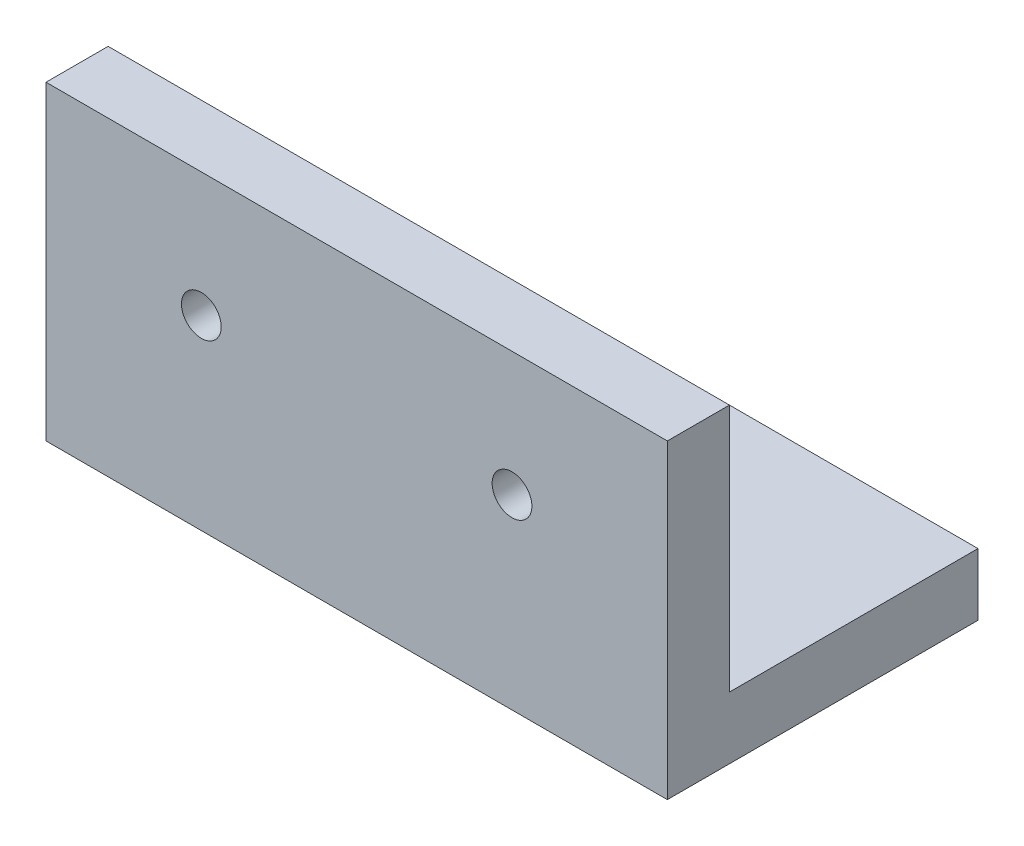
from build123d import *

# Parameters (mm, degrees)
SKETCH1_W           = 50
SKETCH1_H           = 25
BOSS_EXTRUDE1_DEPTH = 5
SKETCH2_W           = 50
SKETCH2_H           = 5
BOSS_EXTRUDE2_DEPTH = 20
SKETCH3_R           = 1.6
CUT_EXTRUDE1_DEPTH  = 45.900820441
SKETCH4_R           = 1.6
CUT_EXTRUDE2_DEPTH  = 45.900820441


with BuildPart() as part:
    # Sketch1 → Boss-Extrude1 (new body)
    with BuildSketch(Plane(origin=(0, 0, 0), x_dir=(1, 0, 0), z_dir=(0, 1, 0))):
        with Locations((6.481481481, 12.5)):
            Rectangle(SKETCH1_W, SKETCH1_H)
    extrude(amount=BOSS_EXTRUDE1_DEPTH)

    # Sketch2 → Boss-Extrude2 (add)
    with BuildSketch(Plane(origin=(0, 5, 0), x_dir=(1, 0, 0), z_dir=(0, 1, 0))):
        with Locations((6.481481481, 2.5)):
            Rectangle(SKETCH2_W, SKETCH2_H)
    extrude(amount=BOSS_EXTRUDE2_DEPTH)

    # Sketch3 → Cut-Extrude1 (cut, through all)
    with BuildSketch(Plane(origin=(0, 5, 0), x_dir=(1, 0, 0), z_dir=(0, 1, 0))):
        with Locations(Location((-6.018518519, 15, 0), (0, 0, 270))):
            Circle(SKETCH3_R)
    cut_extrude1 = extrude(amount=-CUT_EXTRUDE1_DEPTH, mode=Mode.SUBTRACT)

    # Mirror1: Cut-Extrude1 across plane
    add(cut_extrude1.mirror(Plane(origin=(6.481481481, 0, 0), x_dir=(0, 0, 1), z_dir=(1, 0, 0))), mode=Mode.SUBTRACT)

    # Sketch4 → Cut-Extrude2 (cut, through all)
    with BuildSketch(Plane(origin=(0, 0, -5), x_dir=(-1, 0, 0), z_dir=(0, 0, -1))):
        with Locations((6.018518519, 15)):
            Circle(SKETCH4_R)
    cut_extrude2 = extrude(amount=-CUT_EXTRUDE2_DEPTH, mode=Mode.SUBTRACT)

    # Mirror2: Cut-Extrude2 across plane
    add(cut_extrude2.mirror(Plane(origin=(6.481481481, 0, 0), x_dir=(0, 0, 1), z_dir=(1, 0, 0))), mode=Mode.SUBTRACT)


solid = part.part
